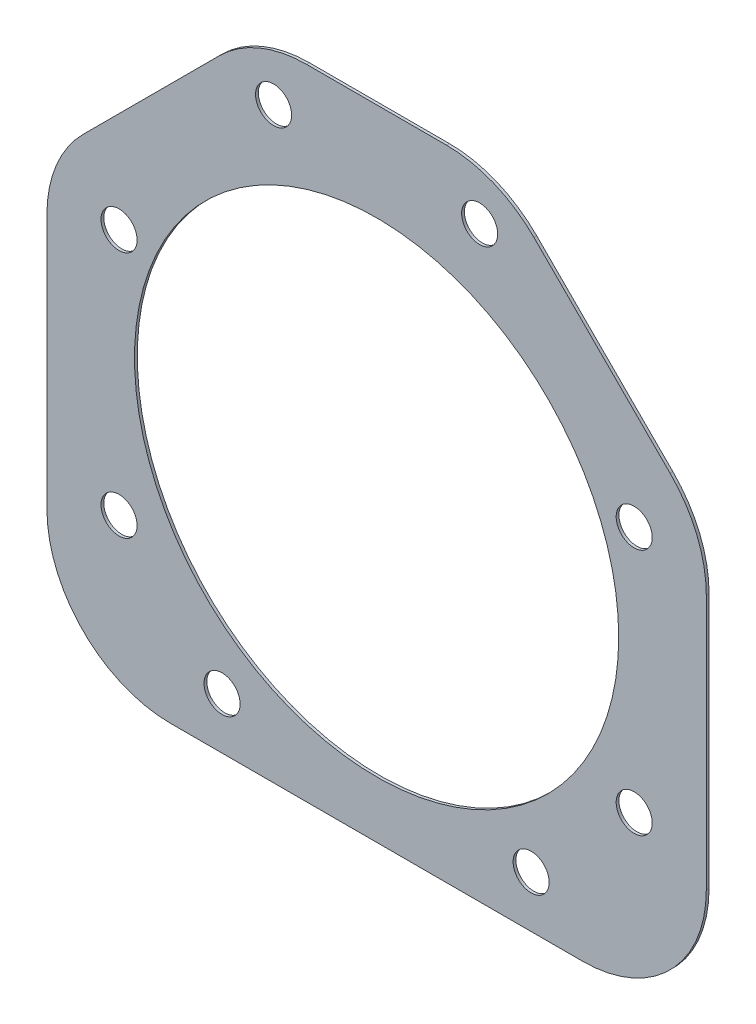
ISO-10303-21;
HEADER;
FILE_DESCRIPTION(('STEP AP214'),'2;1');
FILE_NAME('part.step','',(''),(''),'','','');
FILE_SCHEMA(('AUTOMOTIVE_DESIGN { 1 0 10303 214 1 1 1 1 }'));
ENDSEC;
DATA;
#1=APPLICATION_CONTEXT('core data for automotive mechanical design processes');
#2=APPLICATION_PROTOCOL_DEFINITION('international standard','automotive_design',2000,#1);
#3=PRODUCT_CONTEXT('',#1,'mechanical');
#4=PRODUCT('Part','Part','',(#3));
#5=PRODUCT_RELATED_PRODUCT_CATEGORY('part','',(#4));
#6=PRODUCT_DEFINITION_FORMATION('','',#4);
#7=PRODUCT_DEFINITION_CONTEXT('part definition',#1,'design');
#8=PRODUCT_DEFINITION('design','',#6,#7);
#9=PRODUCT_DEFINITION_SHAPE('','',#8);
#10=(LENGTH_UNIT() NAMED_UNIT(*) SI_UNIT(.MILLI.,.METRE.));
#11=(NAMED_UNIT(*) PLANE_ANGLE_UNIT() SI_UNIT($,.RADIAN.));
#12=(NAMED_UNIT(*) SI_UNIT($,.STERADIAN.) SOLID_ANGLE_UNIT());
#13=UNCERTAINTY_MEASURE_WITH_UNIT(LENGTH_MEASURE(1.E-05),#10,'distance_accuracy_value','');
#14=(GEOMETRIC_REPRESENTATION_CONTEXT(3) GLOBAL_UNCERTAINTY_ASSIGNED_CONTEXT((#13)) GLOBAL_UNIT_ASSIGNED_CONTEXT((#10,
#11,#12)) REPRESENTATION_CONTEXT('',''));
#15=CARTESIAN_POINT('',(0.,0.,0.));
#16=DIRECTION('',(0.,0.,1.));
#17=DIRECTION('',(1.,0.,0.));
#18=AXIS2_PLACEMENT_3D('',#15,#16,#17);
#19=CARTESIAN_POINT('',(-20.,7.78679656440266,0.27));
#20=DIRECTION('',(0.,0.,1.));
#21=DIRECTION('',(1.,0.,0.));
#22=AXIS2_PLACEMENT_3D('',#19,#20,#21);
#23=PLANE('',#22);
#24=CARTESIAN_POINT('',(15.,-24.,0.27));
#25=DIRECTION('',(0.,0.,1.));
#26=DIRECTION('',(1.,0.,0.));
#27=AXIS2_PLACEMENT_3D('',#24,#25,#26);
#28=CIRCLE('',#27,1.75);
#29=CARTESIAN_POINT('',(16.75,-24.,0.27));
#30=VERTEX_POINT('',#29);
#31=EDGE_CURVE('E325',#30,#30,#28,.T.);
#32=ORIENTED_EDGE('',*,*,#31,.F.);
#33=EDGE_LOOP('',(#32));
#34=FACE_BOUND('',#33,.T.);
#35=CARTESIAN_POINT('',(25.,-14.,0.27));
#36=DIRECTION('',(0.,0.,1.));
#37=DIRECTION('',(1.,0.,0.));
#38=AXIS2_PLACEMENT_3D('',#35,#36,#37);
#39=CIRCLE('',#38,1.75);
#40=CARTESIAN_POINT('',(26.75,-14.,0.27));
#41=VERTEX_POINT('',#40);
#42=EDGE_CURVE('E337',#41,#41,#39,.T.);
#43=ORIENTED_EDGE('',*,*,#42,.F.);
#44=EDGE_LOOP('',(#43));
#45=FACE_BOUND('',#44,.T.);
#46=CARTESIAN_POINT('',(25.,10.,0.27));
#47=DIRECTION('',(0.,0.,1.));
#48=DIRECTION('',(1.,0.,0.));
#49=AXIS2_PLACEMENT_3D('',#46,#47,#48);
#50=CIRCLE('',#49,1.75);
#51=CARTESIAN_POINT('',(26.75,10.,0.27));
#52=VERTEX_POINT('',#51);
#53=EDGE_CURVE('E349',#52,#52,#50,.T.);
#54=ORIENTED_EDGE('',*,*,#53,.F.);
#55=EDGE_LOOP('',(#54));
#56=FACE_BOUND('',#55,.T.);
#57=CARTESIAN_POINT('',(10.,28.,0.27));
#58=DIRECTION('',(0.,0.,1.));
#59=DIRECTION('',(1.,0.,0.));
#60=AXIS2_PLACEMENT_3D('',#57,#58,#59);
#61=CIRCLE('',#60,1.75);
#62=CARTESIAN_POINT('',(11.75,28.,0.27));
#63=VERTEX_POINT('',#62);
#64=EDGE_CURVE('E361',#63,#63,#61,.T.);
#65=ORIENTED_EDGE('',*,*,#64,.F.);
#66=EDGE_LOOP('',(#65));
#67=FACE_BOUND('',#66,.T.);
#68=CARTESIAN_POINT('',(-20.,7.78679656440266,0.27));
#69=DIRECTION('',(0.,0.,1.));
#70=DIRECTION('',(1.,0.,0.));
#71=AXIS2_PLACEMENT_3D('',#68,#69,#70);
#72=CIRCLE('',#71,12.);
#73=CARTESIAN_POINT('',(-28.4852813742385,16.2720779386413,0.27));
#74=VERTEX_POINT('',#73);
#75=CARTESIAN_POINT('',(-32.,7.78679656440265,0.27));
#76=VERTEX_POINT('',#75);
#77=EDGE_CURVE('E165',#74,#76,#72,.T.);
#78=ORIENTED_EDGE('',*,*,#77,.T.);
#79=DIRECTION('',(0.,-1.,0.));
#80=VECTOR('',#79,1.);
#81=CARTESIAN_POINT('',(-32.,-17.0000000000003,0.27));
#82=LINE('',#81,#80);
#83=CARTESIAN_POINT('',(-32.,-17.0000000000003,0.27));
#84=VERTEX_POINT('',#83);
#85=EDGE_CURVE('E134',#76,#84,#82,.T.);
#86=ORIENTED_EDGE('',*,*,#85,.T.);
#87=CARTESIAN_POINT('',(-20.,-17.0000000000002,0.27));
#88=DIRECTION('',(0.,0.,1.));
#89=DIRECTION('',(1.,0.,0.));
#90=AXIS2_PLACEMENT_3D('',#87,#88,#89);
#91=CIRCLE('',#90,12.);
#92=CARTESIAN_POINT('',(-19.9999999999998,-29.0000000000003,0.27));
#93=VERTEX_POINT('',#92);
#94=EDGE_CURVE('E168',#84,#93,#91,.T.);
#95=ORIENTED_EDGE('',*,*,#94,.T.);
#96=DIRECTION('',(1.,0.,0.));
#97=VECTOR('',#96,1.);
#98=CARTESIAN_POINT('',(20.0000000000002,-28.9999999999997,0.27));
#99=LINE('',#98,#97);
#100=CARTESIAN_POINT('',(20.0000000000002,-28.9999999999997,0.27));
#101=VERTEX_POINT('',#100);
#102=EDGE_CURVE('E170',#93,#101,#99,.T.);
#103=ORIENTED_EDGE('',*,*,#102,.T.);
#104=CARTESIAN_POINT('',(20.,-16.9999999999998,0.27));
#105=DIRECTION('',(0.,0.,1.));
#106=DIRECTION('',(1.,0.,0.));
#107=AXIS2_PLACEMENT_3D('',#104,#105,#106);
#108=CIRCLE('',#107,12.);
#109=CARTESIAN_POINT('',(32.,-16.9999999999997,0.27));
#110=VERTEX_POINT('',#109);
#111=EDGE_CURVE('E172',#101,#110,#108,.T.);
#112=ORIENTED_EDGE('',*,*,#111,.T.);
#113=DIRECTION('',(0.,1.,0.));
#114=VECTOR('',#113,1.);
#115=CARTESIAN_POINT('',(32.,7.78679656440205,0.27));
#116=LINE('',#115,#114);
#117=CARTESIAN_POINT('',(32.,7.78679656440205,0.27));
#118=VERTEX_POINT('',#117);
#119=EDGE_CURVE('E174',#110,#118,#116,.T.);
#120=ORIENTED_EDGE('',*,*,#119,.T.);
#121=CARTESIAN_POINT('',(20.,7.78679656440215,0.27));
#122=DIRECTION('',(0.,0.,1.));
#123=DIRECTION('',(1.,0.,0.));
#124=AXIS2_PLACEMENT_3D('',#121,#122,#123);
#125=CIRCLE('',#124,12.);
#126=CARTESIAN_POINT('',(28.4852813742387,16.2720779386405,0.27));
#127=VERTEX_POINT('',#126);
#128=EDGE_CURVE('E176',#118,#127,#125,.T.);
#129=ORIENTED_EDGE('',*,*,#128,.T.);
#130=DIRECTION('',(-0.707106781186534,0.707106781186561,0.));
#131=VECTOR('',#130,1.);
#132=CARTESIAN_POINT('',(15.2720779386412,29.4852813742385,0.27));
#133=LINE('',#132,#131);
#134=CARTESIAN_POINT('',(15.2720779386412,29.4852813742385,0.27));
#135=VERTEX_POINT('',#134);
#136=EDGE_CURVE('E178',#127,#135,#133,.T.);
#137=ORIENTED_EDGE('',*,*,#136,.T.);
#138=CARTESIAN_POINT('',(6.78679656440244,21.0000000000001,0.27));
#139=DIRECTION('',(0.,0.,1.));
#140=DIRECTION('',(1.,0.,0.));
#141=AXIS2_PLACEMENT_3D('',#138,#139,#140);
#142=CIRCLE('',#141,12.);
#143=CARTESIAN_POINT('',(6.78679656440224,33.0000000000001,0.27));
#144=VERTEX_POINT('',#143);
#145=EDGE_CURVE('E180',#135,#144,#142,.T.);
#146=ORIENTED_EDGE('',*,*,#145,.T.);
#147=DIRECTION('',(-1.,0.,0.));
#148=VECTOR('',#147,1.);
#149=CARTESIAN_POINT('',(-6.7867965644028,32.9999999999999,0.27));
#150=LINE('',#149,#148);
#151=CARTESIAN_POINT('',(-6.7867965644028,32.9999999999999,0.27));
#152=VERTEX_POINT('',#151);
#153=EDGE_CURVE('E182',#144,#152,#150,.T.);
#154=ORIENTED_EDGE('',*,*,#153,.T.);
#155=CARTESIAN_POINT('',(-6.78679656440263,20.9999999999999,0.27));
#156=DIRECTION('',(0.,0.,1.));
#157=DIRECTION('',(1.,0.,0.));
#158=AXIS2_PLACEMENT_3D('',#155,#156,#157);
#159=CIRCLE('',#158,12.);
#160=CARTESIAN_POINT('',(-15.2720779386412,29.4852813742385,0.27));
#161=VERTEX_POINT('',#160);
#162=EDGE_CURVE('E51',#152,#161,#159,.T.);
#163=ORIENTED_EDGE('',*,*,#162,.T.);
#164=DIRECTION('',(-0.707106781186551,-0.707106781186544,0.));
#165=VECTOR('',#164,1.);
#166=CARTESIAN_POINT('',(-28.4852813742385,16.2720779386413,0.27));
#167=LINE('',#166,#165);
#168=EDGE_CURVE('E46',#161,#74,#167,.T.);
#169=ORIENTED_EDGE('',*,*,#168,.T.);
#170=EDGE_LOOP('',(#78,#86,#95,#103,#112,#120,#129,#137,#146,#154,#163,#169));
#171=FACE_BOUND('',#170,.T.);
#172=CARTESIAN_POINT('',(0.,0.,0.27));
#173=DIRECTION('',(0.,0.,1.));
#174=DIRECTION('',(1.,0.,0.));
#175=AXIS2_PLACEMENT_3D('',#172,#173,#174);
#176=CIRCLE('',#175,23.5);
#177=CARTESIAN_POINT('',(23.5,0.,0.27));
#178=VERTEX_POINT('',#177);
#179=EDGE_CURVE('E139',#178,#178,#176,.T.);
#180=ORIENTED_EDGE('',*,*,#179,.F.);
#181=EDGE_LOOP('',(#180));
#182=FACE_BOUND('',#181,.T.);
#183=CARTESIAN_POINT('',(-10.,28.,0.27));
#184=DIRECTION('',(0.,0.,1.));
#185=DIRECTION('',(-1.,0.,0.));
#186=AXIS2_PLACEMENT_3D('',#183,#184,#185);
#187=CIRCLE('',#186,1.75);
#188=CARTESIAN_POINT('',(-11.75,28.,0.27));
#189=VERTEX_POINT('',#188);
#190=EDGE_CURVE('E355',#189,#189,#187,.T.);
#191=ORIENTED_EDGE('',*,*,#190,.F.);
#192=EDGE_LOOP('',(#191));
#193=FACE_BOUND('',#192,.T.);
#194=CARTESIAN_POINT('',(-25.,10.,0.27));
#195=DIRECTION('',(0.,0.,1.));
#196=DIRECTION('',(-1.,0.,0.));
#197=AXIS2_PLACEMENT_3D('',#194,#195,#196);
#198=CIRCLE('',#197,1.75);
#199=CARTESIAN_POINT('',(-26.75,10.,0.27));
#200=VERTEX_POINT('',#199);
#201=EDGE_CURVE('E343',#200,#200,#198,.T.);
#202=ORIENTED_EDGE('',*,*,#201,.F.);
#203=EDGE_LOOP('',(#202));
#204=FACE_BOUND('',#203,.T.);
#205=CARTESIAN_POINT('',(-25.,-14.,0.27));
#206=DIRECTION('',(0.,0.,1.));
#207=DIRECTION('',(-1.,0.,0.));
#208=AXIS2_PLACEMENT_3D('',#205,#206,#207);
#209=CIRCLE('',#208,1.75);
#210=CARTESIAN_POINT('',(-26.75,-14.,0.27));
#211=VERTEX_POINT('',#210);
#212=EDGE_CURVE('E331',#211,#211,#209,.T.);
#213=ORIENTED_EDGE('',*,*,#212,.F.);
#214=EDGE_LOOP('',(#213));
#215=FACE_BOUND('',#214,.T.);
#216=CARTESIAN_POINT('',(-15.,-24.,0.27));
#217=DIRECTION('',(0.,0.,1.));
#218=DIRECTION('',(-1.,0.,0.));
#219=AXIS2_PLACEMENT_3D('',#216,#217,#218);
#220=CIRCLE('',#219,1.75);
#221=CARTESIAN_POINT('',(-16.75,-24.,0.27));
#222=VERTEX_POINT('',#221);
#223=EDGE_CURVE('E314',#222,#222,#220,.T.);
#224=ORIENTED_EDGE('',*,*,#223,.F.);
#225=EDGE_LOOP('',(#224));
#226=FACE_BOUND('',#225,.T.);
#227=ADVANCED_FACE('F31',(#34,#45,#56,#67,#171,#182,#193,#204,#215,#226),#23,.T.);
#228=CARTESIAN_POINT('',(-20.,7.78679656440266,0.));
#229=DIRECTION('',(0.,0.,1.));
#230=DIRECTION('',(1.,0.,0.));
#231=AXIS2_PLACEMENT_3D('',#228,#229,#230);
#232=PLANE('',#231);
#233=CARTESIAN_POINT('',(15.,-24.,0.));
#234=DIRECTION('',(0.,0.,1.));
#235=DIRECTION('',(1.,0.,0.));
#236=AXIS2_PLACEMENT_3D('',#233,#234,#235);
#237=CIRCLE('',#236,1.75);
#238=CARTESIAN_POINT('',(16.75,-24.,0.));
#239=VERTEX_POINT('',#238);
#240=EDGE_CURVE('E320',#239,#239,#237,.T.);
#241=ORIENTED_EDGE('',*,*,#240,.T.);
#242=EDGE_LOOP('',(#241));
#243=FACE_BOUND('',#242,.T.);
#244=CARTESIAN_POINT('',(25.,-14.,0.));
#245=DIRECTION('',(0.,0.,1.));
#246=DIRECTION('',(1.,0.,0.));
#247=AXIS2_PLACEMENT_3D('',#244,#245,#246);
#248=CIRCLE('',#247,1.75);
#249=CARTESIAN_POINT('',(26.75,-14.,0.));
#250=VERTEX_POINT('',#249);
#251=EDGE_CURVE('E334',#250,#250,#248,.T.);
#252=ORIENTED_EDGE('',*,*,#251,.T.);
#253=EDGE_LOOP('',(#252));
#254=FACE_BOUND('',#253,.T.);
#255=CARTESIAN_POINT('',(25.,10.,0.));
#256=DIRECTION('',(0.,0.,1.));
#257=DIRECTION('',(1.,0.,0.));
#258=AXIS2_PLACEMENT_3D('',#255,#256,#257);
#259=CIRCLE('',#258,1.75);
#260=CARTESIAN_POINT('',(26.75,10.,0.));
#261=VERTEX_POINT('',#260);
#262=EDGE_CURVE('E346',#261,#261,#259,.T.);
#263=ORIENTED_EDGE('',*,*,#262,.T.);
#264=EDGE_LOOP('',(#263));
#265=FACE_BOUND('',#264,.T.);
#266=CARTESIAN_POINT('',(10.,28.,0.));
#267=DIRECTION('',(0.,0.,1.));
#268=DIRECTION('',(1.,0.,0.));
#269=AXIS2_PLACEMENT_3D('',#266,#267,#268);
#270=CIRCLE('',#269,1.75);
#271=CARTESIAN_POINT('',(11.75,28.,0.));
#272=VERTEX_POINT('',#271);
#273=EDGE_CURVE('E358',#272,#272,#270,.T.);
#274=ORIENTED_EDGE('',*,*,#273,.T.);
#275=EDGE_LOOP('',(#274));
#276=FACE_BOUND('',#275,.T.);
#277=CARTESIAN_POINT('',(-20.,7.78679656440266,0.));
#278=DIRECTION('',(0.,0.,1.));
#279=DIRECTION('',(1.,0.,0.));
#280=AXIS2_PLACEMENT_3D('',#277,#278,#279);
#281=CIRCLE('',#280,12.);
#282=CARTESIAN_POINT('',(-28.4852813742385,16.2720779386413,0.));
#283=VERTEX_POINT('',#282);
#284=CARTESIAN_POINT('',(-32.,7.78679656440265,0.));
#285=VERTEX_POINT('',#284);
#286=EDGE_CURVE('E125',#283,#285,#281,.T.);
#287=ORIENTED_EDGE('',*,*,#286,.F.);
#288=DIRECTION('',(-0.707106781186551,-0.707106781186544,0.));
#289=VECTOR('',#288,1.);
#290=CARTESIAN_POINT('',(-28.4852813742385,16.2720779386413,0.));
#291=LINE('',#290,#289);
#292=CARTESIAN_POINT('',(-15.2720779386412,29.4852813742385,0.));
#293=VERTEX_POINT('',#292);
#294=EDGE_CURVE('E163',#293,#283,#291,.T.);
#295=ORIENTED_EDGE('',*,*,#294,.F.);
#296=CARTESIAN_POINT('',(-6.78679656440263,20.9999999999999,0.));
#297=DIRECTION('',(0.,0.,1.));
#298=DIRECTION('',(1.,0.,0.));
#299=AXIS2_PLACEMENT_3D('',#296,#297,#298);
#300=CIRCLE('',#299,12.);
#301=CARTESIAN_POINT('',(-6.7867965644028,32.9999999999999,0.));
#302=VERTEX_POINT('',#301);
#303=EDGE_CURVE('E161',#302,#293,#300,.T.);
#304=ORIENTED_EDGE('',*,*,#303,.F.);
#305=DIRECTION('',(-1.,0.,0.));
#306=VECTOR('',#305,1.);
#307=CARTESIAN_POINT('',(-6.7867965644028,32.9999999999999,0.));
#308=LINE('',#307,#306);
#309=CARTESIAN_POINT('',(6.78679656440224,33.0000000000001,0.));
#310=VERTEX_POINT('',#309);
#311=EDGE_CURVE('E159',#310,#302,#308,.T.);
#312=ORIENTED_EDGE('',*,*,#311,.F.);
#313=CARTESIAN_POINT('',(6.78679656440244,21.0000000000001,0.));
#314=DIRECTION('',(0.,0.,1.));
#315=DIRECTION('',(1.,0.,0.));
#316=AXIS2_PLACEMENT_3D('',#313,#314,#315);
#317=CIRCLE('',#316,12.);
#318=CARTESIAN_POINT('',(15.2720779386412,29.4852813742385,0.));
#319=VERTEX_POINT('',#318);
#320=EDGE_CURVE('E157',#319,#310,#317,.T.);
#321=ORIENTED_EDGE('',*,*,#320,.F.);
#322=DIRECTION('',(-0.707106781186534,0.707106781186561,0.));
#323=VECTOR('',#322,1.);
#324=CARTESIAN_POINT('',(15.2720779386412,29.4852813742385,0.));
#325=LINE('',#324,#323);
#326=CARTESIAN_POINT('',(28.4852813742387,16.2720779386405,0.));
#327=VERTEX_POINT('',#326);
#328=EDGE_CURVE('E155',#327,#319,#325,.T.);
#329=ORIENTED_EDGE('',*,*,#328,.F.);
#330=CARTESIAN_POINT('',(20.,7.78679656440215,0.));
#331=DIRECTION('',(0.,0.,1.));
#332=DIRECTION('',(1.,0.,0.));
#333=AXIS2_PLACEMENT_3D('',#330,#331,#332);
#334=CIRCLE('',#333,12.);
#335=CARTESIAN_POINT('',(32.,7.78679656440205,0.));
#336=VERTEX_POINT('',#335);
#337=EDGE_CURVE('E153',#336,#327,#334,.T.);
#338=ORIENTED_EDGE('',*,*,#337,.F.);
#339=DIRECTION('',(0.,1.,0.));
#340=VECTOR('',#339,1.);
#341=CARTESIAN_POINT('',(32.,7.78679656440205,0.));
#342=LINE('',#341,#340);
#343=CARTESIAN_POINT('',(32.,-16.9999999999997,0.));
#344=VERTEX_POINT('',#343);
#345=EDGE_CURVE('E151',#344,#336,#342,.T.);
#346=ORIENTED_EDGE('',*,*,#345,.F.);
#347=CARTESIAN_POINT('',(20.,-16.9999999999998,0.));
#348=DIRECTION('',(0.,0.,1.));
#349=DIRECTION('',(1.,0.,0.));
#350=AXIS2_PLACEMENT_3D('',#347,#348,#349);
#351=CIRCLE('',#350,12.);
#352=CARTESIAN_POINT('',(20.0000000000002,-28.9999999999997,0.));
#353=VERTEX_POINT('',#352);
#354=EDGE_CURVE('E149',#353,#344,#351,.T.);
#355=ORIENTED_EDGE('',*,*,#354,.F.);
#356=DIRECTION('',(1.,0.,0.));
#357=VECTOR('',#356,1.);
#358=CARTESIAN_POINT('',(20.0000000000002,-28.9999999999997,0.));
#359=LINE('',#358,#357);
#360=CARTESIAN_POINT('',(-19.9999999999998,-29.0000000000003,0.));
#361=VERTEX_POINT('',#360);
#362=EDGE_CURVE('E147',#361,#353,#359,.T.);
#363=ORIENTED_EDGE('',*,*,#362,.F.);
#364=CARTESIAN_POINT('',(-20.,-17.0000000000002,0.));
#365=DIRECTION('',(0.,0.,1.));
#366=DIRECTION('',(1.,0.,0.));
#367=AXIS2_PLACEMENT_3D('',#364,#365,#366);
#368=CIRCLE('',#367,12.);
#369=CARTESIAN_POINT('',(-32.,-17.0000000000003,0.));
#370=VERTEX_POINT('',#369);
#371=EDGE_CURVE('E127',#370,#361,#368,.T.);
#372=ORIENTED_EDGE('',*,*,#371,.F.);
#373=DIRECTION('',(0.,-1.,0.));
#374=VECTOR('',#373,1.);
#375=CARTESIAN_POINT('',(-32.,-17.0000000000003,0.));
#376=LINE('',#375,#374);
#377=EDGE_CURVE('E120',#285,#370,#376,.T.);
#378=ORIENTED_EDGE('',*,*,#377,.F.);
#379=EDGE_LOOP('',(#287,#295,#304,#312,#321,#329,#338,#346,#355,#363,#372,#378));
#380=FACE_BOUND('',#379,.T.);
#381=CARTESIAN_POINT('',(0.,0.,0.));
#382=DIRECTION('',(0.,0.,1.));
#383=DIRECTION('',(1.,0.,0.));
#384=AXIS2_PLACEMENT_3D('',#381,#382,#383);
#385=CIRCLE('',#384,23.5);
#386=CARTESIAN_POINT('',(23.5,0.,0.));
#387=VERTEX_POINT('',#386);
#388=EDGE_CURVE('E142',#387,#387,#385,.T.);
#389=ORIENTED_EDGE('',*,*,#388,.T.);
#390=EDGE_LOOP('',(#389));
#391=FACE_BOUND('',#390,.T.);
#392=CARTESIAN_POINT('',(-10.,28.,0.));
#393=DIRECTION('',(0.,0.,1.));
#394=DIRECTION('',(-1.,0.,0.));
#395=AXIS2_PLACEMENT_3D('',#392,#393,#394);
#396=CIRCLE('',#395,1.75);
#397=CARTESIAN_POINT('',(-11.75,28.,0.));
#398=VERTEX_POINT('',#397);
#399=EDGE_CURVE('E352',#398,#398,#396,.T.);
#400=ORIENTED_EDGE('',*,*,#399,.T.);
#401=EDGE_LOOP('',(#400));
#402=FACE_BOUND('',#401,.T.);
#403=CARTESIAN_POINT('',(-25.,10.,0.));
#404=DIRECTION('',(0.,0.,1.));
#405=DIRECTION('',(-1.,0.,0.));
#406=AXIS2_PLACEMENT_3D('',#403,#404,#405);
#407=CIRCLE('',#406,1.75);
#408=CARTESIAN_POINT('',(-26.75,10.,0.));
#409=VERTEX_POINT('',#408);
#410=EDGE_CURVE('E340',#409,#409,#407,.T.);
#411=ORIENTED_EDGE('',*,*,#410,.T.);
#412=EDGE_LOOP('',(#411));
#413=FACE_BOUND('',#412,.T.);
#414=CARTESIAN_POINT('',(-25.,-14.,0.));
#415=DIRECTION('',(0.,0.,1.));
#416=DIRECTION('',(-1.,0.,0.));
#417=AXIS2_PLACEMENT_3D('',#414,#415,#416);
#418=CIRCLE('',#417,1.75);
#419=CARTESIAN_POINT('',(-26.75,-14.,0.));
#420=VERTEX_POINT('',#419);
#421=EDGE_CURVE('E328',#420,#420,#418,.T.);
#422=ORIENTED_EDGE('',*,*,#421,.T.);
#423=EDGE_LOOP('',(#422));
#424=FACE_BOUND('',#423,.T.);
#425=CARTESIAN_POINT('',(-15.,-24.,0.));
#426=DIRECTION('',(0.,0.,1.));
#427=DIRECTION('',(-1.,0.,0.));
#428=AXIS2_PLACEMENT_3D('',#425,#426,#427);
#429=CIRCLE('',#428,1.75);
#430=CARTESIAN_POINT('',(-16.75,-24.,0.));
#431=VERTEX_POINT('',#430);
#432=EDGE_CURVE('E317',#431,#431,#429,.T.);
#433=ORIENTED_EDGE('',*,*,#432,.T.);
#434=EDGE_LOOP('',(#433));
#435=FACE_BOUND('',#434,.T.);
#436=ADVANCED_FACE('F121',(#243,#254,#265,#276,#380,#391,#402,#413,#424,#435),#232,.F.);
#437=CARTESIAN_POINT('',(-20.,7.78679656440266,0.27));
#438=DIRECTION('',(0.,0.,-1.));
#439=DIRECTION('',(-1.,0.,0.));
#440=AXIS2_PLACEMENT_3D('',#437,#438,#439);
#441=CYLINDRICAL_SURFACE('',#440,12.);
#442=ORIENTED_EDGE('',*,*,#286,.T.);
#443=DIRECTION('',(0.,0.,-1.));
#444=VECTOR('',#443,1.);
#445=CARTESIAN_POINT('',(-32.,7.78679656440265,0.27));
#446=LINE('',#445,#444);
#447=EDGE_CURVE('E11',#76,#285,#446,.T.);
#448=ORIENTED_EDGE('',*,*,#447,.F.);
#449=ORIENTED_EDGE('',*,*,#77,.F.);
#450=DIRECTION('',(0.,0.,-1.));
#451=VECTOR('',#450,1.);
#452=CARTESIAN_POINT('',(-28.4852813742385,16.2720779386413,0.27));
#453=LINE('',#452,#451);
#454=EDGE_CURVE('E138',#74,#283,#453,.T.);
#455=ORIENTED_EDGE('',*,*,#454,.T.);
#456=EDGE_LOOP('',(#442,#448,#449,#455));
#457=FACE_BOUND('',#456,.T.);
#458=ADVANCED_FACE('F33',(#457),#441,.T.);
#459=CARTESIAN_POINT('',(-32.,-17.0000000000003,0.27));
#460=DIRECTION('',(1.,0.,0.));
#461=DIRECTION('',(0.,0.,-1.));
#462=AXIS2_PLACEMENT_3D('',#459,#460,#461);
#463=PLANE('',#462);
#464=ORIENTED_EDGE('',*,*,#377,.T.);
#465=DIRECTION('',(0.,0.,-1.));
#466=VECTOR('',#465,1.);
#467=CARTESIAN_POINT('',(-32.,-17.0000000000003,0.27));
#468=LINE('',#467,#466);
#469=EDGE_CURVE('E39',#84,#370,#468,.T.);
#470=ORIENTED_EDGE('',*,*,#469,.F.);
#471=ORIENTED_EDGE('',*,*,#85,.F.);
#472=ORIENTED_EDGE('',*,*,#447,.T.);
#473=EDGE_LOOP('',(#464,#470,#471,#472));
#474=FACE_BOUND('',#473,.T.);
#475=ADVANCED_FACE('F133',(#474),#463,.F.);
#476=CARTESIAN_POINT('',(-20.,-17.0000000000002,0.27));
#477=DIRECTION('',(0.,0.,-1.));
#478=DIRECTION('',(-1.,0.,0.));
#479=AXIS2_PLACEMENT_3D('',#476,#477,#478);
#480=CYLINDRICAL_SURFACE('',#479,12.);
#481=ORIENTED_EDGE('',*,*,#371,.T.);
#482=DIRECTION('',(0.,0.,-1.));
#483=VECTOR('',#482,1.);
#484=CARTESIAN_POINT('',(-19.9999999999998,-29.0000000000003,0.27));
#485=LINE('',#484,#483);
#486=EDGE_CURVE('E211',#93,#361,#485,.T.);
#487=ORIENTED_EDGE('',*,*,#486,.F.);
#488=ORIENTED_EDGE('',*,*,#94,.F.);
#489=ORIENTED_EDGE('',*,*,#469,.T.);
#490=EDGE_LOOP('',(#481,#487,#488,#489));
#491=FACE_BOUND('',#490,.T.);
#492=ADVANCED_FACE('F215',(#491),#480,.T.);
#493=CARTESIAN_POINT('',(20.0000000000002,-28.9999999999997,0.27));
#494=DIRECTION('',(0.,1.,0.));
#495=DIRECTION('',(-1.,0.,0.));
#496=AXIS2_PLACEMENT_3D('',#493,#494,#495);
#497=PLANE('',#496);
#498=ORIENTED_EDGE('',*,*,#362,.T.);
#499=DIRECTION('',(0.,0.,-1.));
#500=VECTOR('',#499,1.);
#501=CARTESIAN_POINT('',(20.0000000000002,-28.9999999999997,0.27));
#502=LINE('',#501,#500);
#503=EDGE_CURVE('E208',#101,#353,#502,.T.);
#504=ORIENTED_EDGE('',*,*,#503,.F.);
#505=ORIENTED_EDGE('',*,*,#102,.F.);
#506=ORIENTED_EDGE('',*,*,#486,.T.);
#507=EDGE_LOOP('',(#498,#504,#505,#506));
#508=FACE_BOUND('',#507,.T.);
#509=ADVANCED_FACE('F223',(#508),#497,.F.);
#510=CARTESIAN_POINT('',(20.,-16.9999999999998,0.27));
#511=DIRECTION('',(0.,0.,-1.));
#512=DIRECTION('',(-1.,0.,0.));
#513=AXIS2_PLACEMENT_3D('',#510,#511,#512);
#514=CYLINDRICAL_SURFACE('',#513,12.);
#515=ORIENTED_EDGE('',*,*,#354,.T.);
#516=DIRECTION('',(0.,0.,-1.));
#517=VECTOR('',#516,1.);
#518=CARTESIAN_POINT('',(32.,-16.9999999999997,0.27));
#519=LINE('',#518,#517);
#520=EDGE_CURVE('E205',#110,#344,#519,.T.);
#521=ORIENTED_EDGE('',*,*,#520,.F.);
#522=ORIENTED_EDGE('',*,*,#111,.F.);
#523=ORIENTED_EDGE('',*,*,#503,.T.);
#524=EDGE_LOOP('',(#515,#521,#522,#523));
#525=FACE_BOUND('',#524,.T.);
#526=ADVANCED_FACE('F226',(#525),#514,.T.);
#527=CARTESIAN_POINT('',(32.,7.78679656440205,0.27));
#528=DIRECTION('',(-1.,0.,0.));
#529=DIRECTION('',(0.,0.,1.));
#530=AXIS2_PLACEMENT_3D('',#527,#528,#529);
#531=PLANE('',#530);
#532=ORIENTED_EDGE('',*,*,#345,.T.);
#533=DIRECTION('',(0.,0.,-1.));
#534=VECTOR('',#533,1.);
#535=CARTESIAN_POINT('',(32.,7.78679656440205,0.27));
#536=LINE('',#535,#534);
#537=EDGE_CURVE('E202',#118,#336,#536,.T.);
#538=ORIENTED_EDGE('',*,*,#537,.F.);
#539=ORIENTED_EDGE('',*,*,#119,.F.);
#540=ORIENTED_EDGE('',*,*,#520,.T.);
#541=EDGE_LOOP('',(#532,#538,#539,#540));
#542=FACE_BOUND('',#541,.T.);
#543=ADVANCED_FACE('F231',(#542),#531,.F.);
#544=CARTESIAN_POINT('',(20.,7.78679656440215,0.27));
#545=DIRECTION('',(0.,0.,-1.));
#546=DIRECTION('',(-1.,0.,0.));
#547=AXIS2_PLACEMENT_3D('',#544,#545,#546);
#548=CYLINDRICAL_SURFACE('',#547,12.);
#549=ORIENTED_EDGE('',*,*,#337,.T.);
#550=DIRECTION('',(0.,0.,-1.));
#551=VECTOR('',#550,1.);
#552=CARTESIAN_POINT('',(28.4852813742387,16.2720779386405,0.27));
#553=LINE('',#552,#551);
#554=EDGE_CURVE('E199',#127,#327,#553,.T.);
#555=ORIENTED_EDGE('',*,*,#554,.F.);
#556=ORIENTED_EDGE('',*,*,#128,.F.);
#557=ORIENTED_EDGE('',*,*,#537,.T.);
#558=EDGE_LOOP('',(#549,#555,#556,#557));
#559=FACE_BOUND('',#558,.T.);
#560=ADVANCED_FACE('F237',(#559),#548,.T.);
#561=CARTESIAN_POINT('',(15.2720779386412,29.4852813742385,0.27));
#562=DIRECTION('',(-0.707106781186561,-0.707106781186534,0.));
#563=DIRECTION('',(0.707106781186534,-0.707106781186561,0.));
#564=AXIS2_PLACEMENT_3D('',#561,#562,#563);
#565=PLANE('',#564);
#566=ORIENTED_EDGE('',*,*,#328,.T.);
#567=DIRECTION('',(0.,0.,-1.));
#568=VECTOR('',#567,1.);
#569=CARTESIAN_POINT('',(15.2720779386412,29.4852813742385,0.27));
#570=LINE('',#569,#568);
#571=EDGE_CURVE('E196',#135,#319,#570,.T.);
#572=ORIENTED_EDGE('',*,*,#571,.F.);
#573=ORIENTED_EDGE('',*,*,#136,.F.);
#574=ORIENTED_EDGE('',*,*,#554,.T.);
#575=EDGE_LOOP('',(#566,#572,#573,#574));
#576=FACE_BOUND('',#575,.T.);
#577=ADVANCED_FACE('F241',(#576),#565,.F.);
#578=CARTESIAN_POINT('',(6.78679656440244,21.0000000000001,0.27));
#579=DIRECTION('',(0.,0.,-1.));
#580=DIRECTION('',(-1.,0.,0.));
#581=AXIS2_PLACEMENT_3D('',#578,#579,#580);
#582=CYLINDRICAL_SURFACE('',#581,12.);
#583=ORIENTED_EDGE('',*,*,#320,.T.);
#584=DIRECTION('',(0.,0.,-1.));
#585=VECTOR('',#584,1.);
#586=CARTESIAN_POINT('',(6.78679656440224,33.0000000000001,0.27));
#587=LINE('',#586,#585);
#588=EDGE_CURVE('E193',#144,#310,#587,.T.);
#589=ORIENTED_EDGE('',*,*,#588,.F.);
#590=ORIENTED_EDGE('',*,*,#145,.F.);
#591=ORIENTED_EDGE('',*,*,#571,.T.);
#592=EDGE_LOOP('',(#583,#589,#590,#591));
#593=FACE_BOUND('',#592,.T.);
#594=ADVANCED_FACE('F246',(#593),#582,.T.);
#595=CARTESIAN_POINT('',(-6.7867965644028,32.9999999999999,0.27));
#596=DIRECTION('',(0.,-1.,0.));
#597=DIRECTION('',(1.,0.,0.));
#598=AXIS2_PLACEMENT_3D('',#595,#596,#597);
#599=PLANE('',#598);
#600=ORIENTED_EDGE('',*,*,#311,.T.);
#601=DIRECTION('',(0.,0.,-1.));
#602=VECTOR('',#601,1.);
#603=CARTESIAN_POINT('',(-6.7867965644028,32.9999999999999,0.27));
#604=LINE('',#603,#602);
#605=EDGE_CURVE('E190',#152,#302,#604,.T.);
#606=ORIENTED_EDGE('',*,*,#605,.F.);
#607=ORIENTED_EDGE('',*,*,#153,.F.);
#608=ORIENTED_EDGE('',*,*,#588,.T.);
#609=EDGE_LOOP('',(#600,#606,#607,#608));
#610=FACE_BOUND('',#609,.T.);
#611=ADVANCED_FACE('F250',(#610),#599,.F.);
#612=CARTESIAN_POINT('',(-6.78679656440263,20.9999999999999,0.27));
#613=DIRECTION('',(0.,0.,-1.));
#614=DIRECTION('',(-1.,0.,0.));
#615=AXIS2_PLACEMENT_3D('',#612,#613,#614);
#616=CYLINDRICAL_SURFACE('',#615,12.);
#617=ORIENTED_EDGE('',*,*,#303,.T.);
#618=DIRECTION('',(0.,0.,-1.));
#619=VECTOR('',#618,1.);
#620=CARTESIAN_POINT('',(-15.2720779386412,29.4852813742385,0.27));
#621=LINE('',#620,#619);
#622=EDGE_CURVE('E187',#161,#293,#621,.T.);
#623=ORIENTED_EDGE('',*,*,#622,.F.);
#624=ORIENTED_EDGE('',*,*,#162,.F.);
#625=ORIENTED_EDGE('',*,*,#605,.T.);
#626=EDGE_LOOP('',(#617,#623,#624,#625));
#627=FACE_BOUND('',#626,.T.);
#628=ADVANCED_FACE('F254',(#627),#616,.T.);
#629=CARTESIAN_POINT('',(-28.4852813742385,16.2720779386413,0.27));
#630=DIRECTION('',(0.707106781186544,-0.707106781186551,0.));
#631=DIRECTION('',(0.707106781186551,0.707106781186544,0.));
#632=AXIS2_PLACEMENT_3D('',#629,#630,#631);
#633=PLANE('',#632);
#634=ORIENTED_EDGE('',*,*,#294,.T.);
#635=ORIENTED_EDGE('',*,*,#454,.F.);
#636=ORIENTED_EDGE('',*,*,#168,.F.);
#637=ORIENTED_EDGE('',*,*,#622,.T.);
#638=EDGE_LOOP('',(#634,#635,#636,#637));
#639=FACE_BOUND('',#638,.T.);
#640=ADVANCED_FACE('F256',(#639),#633,.F.);
#641=CARTESIAN_POINT('',(0.,0.,0.27));
#642=DIRECTION('',(0.,0.,-1.));
#643=DIRECTION('',(-1.,0.,0.));
#644=AXIS2_PLACEMENT_3D('',#641,#642,#643);
#645=CYLINDRICAL_SURFACE('',#644,23.5);
#646=ORIENTED_EDGE('',*,*,#179,.T.);
#647=EDGE_LOOP('',(#646));
#648=FACE_BOUND('',#647,.T.);
#649=ORIENTED_EDGE('',*,*,#388,.F.);
#650=EDGE_LOOP('',(#649));
#651=FACE_BOUND('',#650,.T.);
#652=ADVANCED_FACE('F258',(#648,#651),#645,.F.);
#653=CARTESIAN_POINT('',(10.,28.,0.27));
#654=DIRECTION('',(0.,0.,-1.));
#655=DIRECTION('',(-1.,0.,0.));
#656=AXIS2_PLACEMENT_3D('',#653,#654,#655);
#657=CYLINDRICAL_SURFACE('',#656,1.75);
#658=ORIENTED_EDGE('',*,*,#64,.T.);
#659=EDGE_LOOP('',(#658));
#660=FACE_BOUND('',#659,.T.);
#661=ORIENTED_EDGE('',*,*,#273,.F.);
#662=EDGE_LOOP('',(#661));
#663=FACE_BOUND('',#662,.T.);
#664=ADVANCED_FACE('F264',(#660,#663),#657,.F.);
#665=CARTESIAN_POINT('',(-10.,28.,0.27));
#666=DIRECTION('',(0.,0.,-1.));
#667=DIRECTION('',(-1.,0.,0.));
#668=AXIS2_PLACEMENT_3D('',#665,#666,#667);
#669=CYLINDRICAL_SURFACE('',#668,1.75);
#670=ORIENTED_EDGE('',*,*,#190,.T.);
#671=EDGE_LOOP('',(#670));
#672=FACE_BOUND('',#671,.T.);
#673=ORIENTED_EDGE('',*,*,#399,.F.);
#674=EDGE_LOOP('',(#673));
#675=FACE_BOUND('',#674,.T.);
#676=ADVANCED_FACE('F281',(#672,#675),#669,.F.);
#677=CARTESIAN_POINT('',(25.,10.,0.27));
#678=DIRECTION('',(0.,0.,-1.));
#679=DIRECTION('',(-1.,0.,0.));
#680=AXIS2_PLACEMENT_3D('',#677,#678,#679);
#681=CYLINDRICAL_SURFACE('',#680,1.75);
#682=ORIENTED_EDGE('',*,*,#53,.T.);
#683=EDGE_LOOP('',(#682));
#684=FACE_BOUND('',#683,.T.);
#685=ORIENTED_EDGE('',*,*,#262,.F.);
#686=EDGE_LOOP('',(#685));
#687=FACE_BOUND('',#686,.T.);
#688=ADVANCED_FACE('F285',(#684,#687),#681,.F.);
#689=CARTESIAN_POINT('',(-25.,10.,0.27));
#690=DIRECTION('',(0.,0.,-1.));
#691=DIRECTION('',(-1.,0.,0.));
#692=AXIS2_PLACEMENT_3D('',#689,#690,#691);
#693=CYLINDRICAL_SURFACE('',#692,1.75);
#694=ORIENTED_EDGE('',*,*,#201,.T.);
#695=EDGE_LOOP('',(#694));
#696=FACE_BOUND('',#695,.T.);
#697=ORIENTED_EDGE('',*,*,#410,.F.);
#698=EDGE_LOOP('',(#697));
#699=FACE_BOUND('',#698,.T.);
#700=ADVANCED_FACE('F289',(#696,#699),#693,.F.);
#701=CARTESIAN_POINT('',(25.,-14.,0.27));
#702=DIRECTION('',(0.,0.,-1.));
#703=DIRECTION('',(-1.,0.,0.));
#704=AXIS2_PLACEMENT_3D('',#701,#702,#703);
#705=CYLINDRICAL_SURFACE('',#704,1.75);
#706=ORIENTED_EDGE('',*,*,#42,.T.);
#707=EDGE_LOOP('',(#706));
#708=FACE_BOUND('',#707,.T.);
#709=ORIENTED_EDGE('',*,*,#251,.F.);
#710=EDGE_LOOP('',(#709));
#711=FACE_BOUND('',#710,.T.);
#712=ADVANCED_FACE('F293',(#708,#711),#705,.F.);
#713=CARTESIAN_POINT('',(-25.,-14.,0.27));
#714=DIRECTION('',(0.,0.,-1.));
#715=DIRECTION('',(-1.,0.,0.));
#716=AXIS2_PLACEMENT_3D('',#713,#714,#715);
#717=CYLINDRICAL_SURFACE('',#716,1.75);
#718=ORIENTED_EDGE('',*,*,#212,.T.);
#719=EDGE_LOOP('',(#718));
#720=FACE_BOUND('',#719,.T.);
#721=ORIENTED_EDGE('',*,*,#421,.F.);
#722=EDGE_LOOP('',(#721));
#723=FACE_BOUND('',#722,.T.);
#724=ADVANCED_FACE('F297',(#720,#723),#717,.F.);
#725=CARTESIAN_POINT('',(15.,-24.,0.27));
#726=DIRECTION('',(0.,0.,-1.));
#727=DIRECTION('',(-1.,0.,0.));
#728=AXIS2_PLACEMENT_3D('',#725,#726,#727);
#729=CYLINDRICAL_SURFACE('',#728,1.75);
#730=ORIENTED_EDGE('',*,*,#31,.T.);
#731=EDGE_LOOP('',(#730));
#732=FACE_BOUND('',#731,.T.);
#733=ORIENTED_EDGE('',*,*,#240,.F.);
#734=EDGE_LOOP('',(#733));
#735=FACE_BOUND('',#734,.T.);
#736=ADVANCED_FACE('F301',(#732,#735),#729,.F.);
#737=CARTESIAN_POINT('',(-15.,-24.,0.27));
#738=DIRECTION('',(0.,0.,-1.));
#739=DIRECTION('',(-1.,0.,0.));
#740=AXIS2_PLACEMENT_3D('',#737,#738,#739);
#741=CYLINDRICAL_SURFACE('',#740,1.75);
#742=ORIENTED_EDGE('',*,*,#223,.T.);
#743=EDGE_LOOP('',(#742));
#744=FACE_BOUND('',#743,.T.);
#745=ORIENTED_EDGE('',*,*,#432,.F.);
#746=EDGE_LOOP('',(#745));
#747=FACE_BOUND('',#746,.T.);
#748=ADVANCED_FACE('F305',(#744,#747),#741,.F.);
#749=CLOSED_SHELL('',(#227,#436,#458,#475,#492,#509,#526,#543,#560,#577,#594,#611,#628,#640,
#652,#664,#676,#688,#700,#712,#724,#736,#748));
#750=MANIFOLD_SOLID_BREP('B2',#749);
#751=ADVANCED_BREP_SHAPE_REPRESENTATION('',(#18,#750),#14);
#752=SHAPE_DEFINITION_REPRESENTATION(#9,#751);
ENDSEC;
END-ISO-10303-21;
